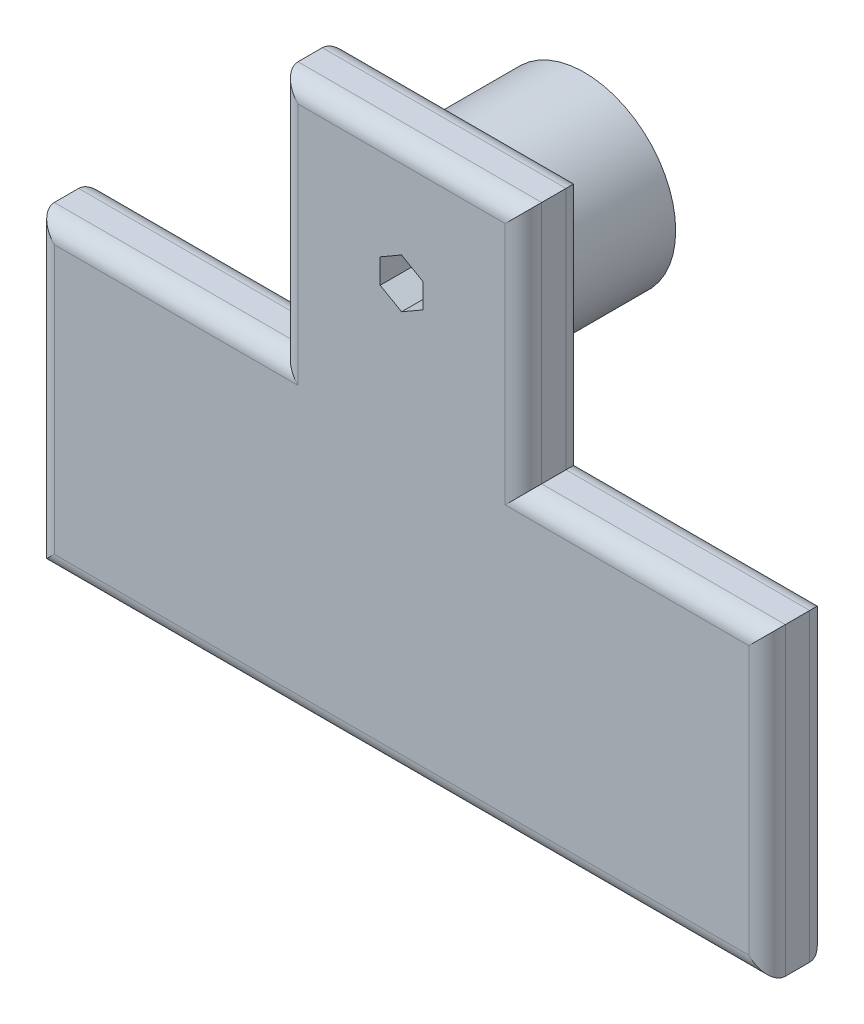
ISO-10303-21;
HEADER;
FILE_DESCRIPTION(('STEP AP214'),'2;1');
FILE_NAME('part.step','',(''),(''),'','','');
FILE_SCHEMA(('AUTOMOTIVE_DESIGN { 1 0 10303 214 1 1 1 1 }'));
ENDSEC;
DATA;
#1=APPLICATION_CONTEXT('core data for automotive mechanical design processes');
#2=APPLICATION_PROTOCOL_DEFINITION('international standard','automotive_design',2000,#1);
#3=PRODUCT_CONTEXT('',#1,'mechanical');
#4=PRODUCT('Part','Part','',(#3));
#5=PRODUCT_RELATED_PRODUCT_CATEGORY('part','',(#4));
#6=PRODUCT_DEFINITION_FORMATION('','',#4);
#7=PRODUCT_DEFINITION_CONTEXT('part definition',#1,'design');
#8=PRODUCT_DEFINITION('design','',#6,#7);
#9=PRODUCT_DEFINITION_SHAPE('','',#8);
#10=(LENGTH_UNIT() NAMED_UNIT(*) SI_UNIT(.MILLI.,.METRE.));
#11=(NAMED_UNIT(*) PLANE_ANGLE_UNIT() SI_UNIT($,.RADIAN.));
#12=(NAMED_UNIT(*) SI_UNIT($,.STERADIAN.) SOLID_ANGLE_UNIT());
#13=UNCERTAINTY_MEASURE_WITH_UNIT(LENGTH_MEASURE(1.E-05),#10,'distance_accuracy_value','');
#14=(GEOMETRIC_REPRESENTATION_CONTEXT(3) GLOBAL_UNCERTAINTY_ASSIGNED_CONTEXT((#13)) GLOBAL_UNIT_ASSIGNED_CONTEXT((#10,
#11,#12)) REPRESENTATION_CONTEXT('',''));
#15=CARTESIAN_POINT('',(0.,0.,0.));
#16=DIRECTION('',(0.,0.,1.));
#17=DIRECTION('',(1.,0.,0.));
#18=AXIS2_PLACEMENT_3D('',#15,#16,#17);
#19=CARTESIAN_POINT('',(0.,0.,-20.));
#20=DIRECTION('',(0.,0.,1.));
#21=DIRECTION('',(1.,0.,0.));
#22=AXIS2_PLACEMENT_3D('',#19,#20,#21);
#23=PLANE('',#22);
#24=CARTESIAN_POINT('',(0.,0.,-20.));
#25=DIRECTION('',(0.,0.,1.));
#26=DIRECTION('',(1.,0.,0.));
#27=AXIS2_PLACEMENT_3D('',#24,#25,#26);
#28=CIRCLE('',#27,15.);
#29=CARTESIAN_POINT('',(15.,0.,-20.));
#30=VERTEX_POINT('',#29);
#31=EDGE_CURVE('E219',#30,#30,#28,.T.);
#32=ORIENTED_EDGE('',*,*,#31,.F.);
#33=EDGE_LOOP('',(#32));
#34=FACE_BOUND('',#33,.T.);
#35=DIRECTION('',(0.866025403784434,-0.500000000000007,0.));
#36=VECTOR('',#35,1.);
#37=CARTESIAN_POINT('',(0.,4.0414518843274,-20.));
#38=LINE('',#37,#36);
#39=CARTESIAN_POINT('',(0.,4.0414518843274,-20.));
#40=VERTEX_POINT('',#39);
#41=CARTESIAN_POINT('',(3.50000000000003,2.02072594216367,-20.));
#42=VERTEX_POINT('',#41);
#43=EDGE_CURVE('E199',#40,#42,#38,.T.);
#44=ORIENTED_EDGE('',*,*,#43,.F.);
#45=DIRECTION('',(0.866025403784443,0.499999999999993,0.));
#46=VECTOR('',#45,1.);
#47=CARTESIAN_POINT('',(-3.5,2.02072594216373,-20.));
#48=LINE('',#47,#46);
#49=CARTESIAN_POINT('',(-3.5,2.02072594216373,-20.));
#50=VERTEX_POINT('',#49);
#51=EDGE_CURVE('E216',#50,#40,#48,.T.);
#52=ORIENTED_EDGE('',*,*,#51,.F.);
#53=DIRECTION('',(0.,1.,0.));
#54=VECTOR('',#53,1.);
#55=CARTESIAN_POINT('',(-3.50000000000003,-2.02072594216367,-20.));
#56=LINE('',#55,#54);
#57=CARTESIAN_POINT('',(-3.50000000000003,-2.02072594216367,-20.));
#58=VERTEX_POINT('',#57);
#59=EDGE_CURVE('E214',#58,#50,#56,.T.);
#60=ORIENTED_EDGE('',*,*,#59,.F.);
#61=DIRECTION('',(-0.866025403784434,0.500000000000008,0.));
#62=VECTOR('',#61,1.);
#63=CARTESIAN_POINT('',(0.,-4.0414518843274,-20.));
#64=LINE('',#63,#62);
#65=CARTESIAN_POINT('',(0.,-4.0414518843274,-20.));
#66=VERTEX_POINT('',#65);
#67=EDGE_CURVE('E209',#66,#58,#64,.T.);
#68=ORIENTED_EDGE('',*,*,#67,.F.);
#69=DIRECTION('',(-0.866025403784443,-0.499999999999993,0.));
#70=VECTOR('',#69,1.);
#71=CARTESIAN_POINT('',(3.49999999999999,-2.02072594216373,-20.));
#72=LINE('',#71,#70);
#73=CARTESIAN_POINT('',(3.49999999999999,-2.02072594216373,-20.));
#74=VERTEX_POINT('',#73);
#75=EDGE_CURVE('E207',#74,#66,#72,.T.);
#76=ORIENTED_EDGE('',*,*,#75,.F.);
#77=DIRECTION('',(0.,-1.,0.));
#78=VECTOR('',#77,1.);
#79=CARTESIAN_POINT('',(3.50000000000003,2.02072594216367,-20.));
#80=LINE('',#79,#78);
#81=EDGE_CURVE('E189',#42,#74,#80,.T.);
#82=ORIENTED_EDGE('',*,*,#81,.F.);
#83=EDGE_LOOP('',(#44,#52,#60,#68,#76,#82));
#84=FACE_BOUND('',#83,.T.);
#85=ADVANCED_FACE('F33',(#34,#84),#23,.F.);
#86=CARTESIAN_POINT('',(0.,0.,10.));
#87=DIRECTION('',(0.,0.,1.));
#88=DIRECTION('',(1.,0.,0.));
#89=AXIS2_PLACEMENT_3D('',#86,#87,#88);
#90=PLANE('',#89);
#91=DIRECTION('',(0.,-1.,0.));
#92=VECTOR('',#91,1.);
#93=CARTESIAN_POINT('',(-57.,-70.,10.));
#94=LINE('',#93,#92);
#95=CARTESIAN_POINT('',(-57.,-23.,10.));
#96=VERTEX_POINT('',#95);
#97=CARTESIAN_POINT('',(-57.,-67.,10.));
#98=VERTEX_POINT('',#97);
#99=EDGE_CURVE('E280',#96,#98,#94,.T.);
#100=ORIENTED_EDGE('',*,*,#99,.T.);
#101=DIRECTION('',(1.,0.,0.));
#102=VECTOR('',#101,1.);
#103=CARTESIAN_POINT('',(60.,-67.,10.));
#104=LINE('',#103,#102);
#105=CARTESIAN_POINT('',(57.,-67.,10.));
#106=VERTEX_POINT('',#105);
#107=EDGE_CURVE('E282',#98,#106,#104,.T.);
#108=ORIENTED_EDGE('',*,*,#107,.T.);
#109=DIRECTION('',(0.,1.,0.));
#110=VECTOR('',#109,1.);
#111=CARTESIAN_POINT('',(57.,-20.,10.));
#112=LINE('',#111,#110);
#113=CARTESIAN_POINT('',(57.,-23.,10.));
#114=VERTEX_POINT('',#113);
#115=EDGE_CURVE('E268',#106,#114,#112,.T.);
#116=ORIENTED_EDGE('',*,*,#115,.T.);
#117=DIRECTION('',(-1.,0.,0.));
#118=VECTOR('',#117,1.);
#119=CARTESIAN_POINT('',(20.,-23.,10.));
#120=LINE('',#119,#118);
#121=CARTESIAN_POINT('',(17.,-23.,10.));
#122=VERTEX_POINT('',#121);
#123=EDGE_CURVE('E270',#114,#122,#120,.T.);
#124=ORIENTED_EDGE('',*,*,#123,.T.);
#125=DIRECTION('',(0.,1.,0.));
#126=VECTOR('',#125,1.);
#127=CARTESIAN_POINT('',(17.,20.,10.));
#128=LINE('',#127,#126);
#129=CARTESIAN_POINT('',(17.,17.,10.));
#130=VERTEX_POINT('',#129);
#131=EDGE_CURVE('E272',#122,#130,#128,.T.);
#132=ORIENTED_EDGE('',*,*,#131,.T.);
#133=DIRECTION('',(-1.,0.,0.));
#134=VECTOR('',#133,1.);
#135=CARTESIAN_POINT('',(-20.,17.,10.));
#136=LINE('',#135,#134);
#137=CARTESIAN_POINT('',(-17.,17.,10.));
#138=VERTEX_POINT('',#137);
#139=EDGE_CURVE('E274',#130,#138,#136,.T.);
#140=ORIENTED_EDGE('',*,*,#139,.T.);
#141=DIRECTION('',(0.,-1.,0.));
#142=VECTOR('',#141,1.);
#143=CARTESIAN_POINT('',(-17.,-20.,10.));
#144=LINE('',#143,#142);
#145=CARTESIAN_POINT('',(-17.,-23.,10.));
#146=VERTEX_POINT('',#145);
#147=EDGE_CURVE('E276',#138,#146,#144,.T.);
#148=ORIENTED_EDGE('',*,*,#147,.T.);
#149=DIRECTION('',(-1.,0.,0.));
#150=VECTOR('',#149,1.);
#151=CARTESIAN_POINT('',(-60.,-23.,10.));
#152=LINE('',#151,#150);
#153=EDGE_CURVE('E278',#146,#96,#152,.T.);
#154=ORIENTED_EDGE('',*,*,#153,.T.);
#155=EDGE_LOOP('',(#100,#108,#116,#124,#132,#140,#148,#154));
#156=FACE_BOUND('',#155,.T.);
#157=DIRECTION('',(0.866025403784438,0.5,0.));
#158=VECTOR('',#157,1.);
#159=CARTESIAN_POINT('',(0.,-4.04145188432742,10.));
#160=LINE('',#159,#158);
#161=CARTESIAN_POINT('',(0.,-4.04145188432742,10.));
#162=VERTEX_POINT('',#161);
#163=CARTESIAN_POINT('',(3.50000000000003,-2.02072594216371,10.));
#164=VERTEX_POINT('',#163);
#165=EDGE_CURVE('E227',#162,#164,#160,.T.);
#166=ORIENTED_EDGE('',*,*,#165,.F.);
#167=DIRECTION('',(0.866025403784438,-0.5,0.));
#168=VECTOR('',#167,1.);
#169=CARTESIAN_POINT('',(-3.50000000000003,-2.02072594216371,10.));
#170=LINE('',#169,#168);
#171=CARTESIAN_POINT('',(-3.50000000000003,-2.02072594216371,10.));
#172=VERTEX_POINT('',#171);
#173=EDGE_CURVE('E225',#172,#162,#170,.T.);
#174=ORIENTED_EDGE('',*,*,#173,.F.);
#175=DIRECTION('',(0.,-1.,0.));
#176=VECTOR('',#175,1.);
#177=CARTESIAN_POINT('',(-3.50000000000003,2.02072594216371,10.));
#178=LINE('',#177,#176);
#179=CARTESIAN_POINT('',(-3.50000000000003,2.02072594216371,10.));
#180=VERTEX_POINT('',#179);
#181=EDGE_CURVE('E235',#180,#172,#178,.T.);
#182=ORIENTED_EDGE('',*,*,#181,.F.);
#183=DIRECTION('',(-0.866025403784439,-0.5,0.));
#184=VECTOR('',#183,1.);
#185=CARTESIAN_POINT('',(0.,4.04145188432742,10.));
#186=LINE('',#185,#184);
#187=CARTESIAN_POINT('',(0.,4.04145188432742,10.));
#188=VERTEX_POINT('',#187);
#189=EDGE_CURVE('E233',#188,#180,#186,.T.);
#190=ORIENTED_EDGE('',*,*,#189,.F.);
#191=DIRECTION('',(-0.866025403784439,0.5,0.));
#192=VECTOR('',#191,1.);
#193=CARTESIAN_POINT('',(3.50000000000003,2.02072594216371,10.));
#194=LINE('',#193,#192);
#195=CARTESIAN_POINT('',(3.50000000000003,2.02072594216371,10.));
#196=VERTEX_POINT('',#195);
#197=EDGE_CURVE('E231',#196,#188,#194,.T.);
#198=ORIENTED_EDGE('',*,*,#197,.F.);
#199=DIRECTION('',(0.,1.,0.));
#200=VECTOR('',#199,1.);
#201=CARTESIAN_POINT('',(3.50000000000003,-2.02072594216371,10.));
#202=LINE('',#201,#200);
#203=EDGE_CURVE('E192',#164,#196,#202,.T.);
#204=ORIENTED_EDGE('',*,*,#203,.F.);
#205=EDGE_LOOP('',(#166,#174,#182,#190,#198,#204));
#206=FACE_BOUND('',#205,.T.);
#207=ADVANCED_FACE('F415',(#156,#206),#90,.T.);
#208=CARTESIAN_POINT('',(0.,0.,0.));
#209=DIRECTION('',(0.,0.,1.));
#210=DIRECTION('',(1.,0.,0.));
#211=AXIS2_PLACEMENT_3D('',#208,#209,#210);
#212=PLANE('',#211);
#213=CARTESIAN_POINT('',(0.,0.,0.));
#214=DIRECTION('',(0.,0.,1.));
#215=DIRECTION('',(1.,0.,0.));
#216=AXIS2_PLACEMENT_3D('',#213,#214,#215);
#217=CIRCLE('',#216,15.);
#218=CARTESIAN_POINT('',(15.,0.,0.));
#219=VERTEX_POINT('',#218);
#220=EDGE_CURVE('E218',#219,#219,#217,.T.);
#221=ORIENTED_EDGE('',*,*,#220,.T.);
#222=EDGE_LOOP('',(#221));
#223=FACE_BOUND('',#222,.T.);
#224=DIRECTION('',(-1.,0.,0.));
#225=VECTOR('',#224,1.);
#226=CARTESIAN_POINT('',(0.,17.,0.));
#227=LINE('',#226,#225);
#228=CARTESIAN_POINT('',(-17.,17.,0.));
#229=VERTEX_POINT('',#228);
#230=CARTESIAN_POINT('',(17.,17.,0.));
#231=VERTEX_POINT('',#230);
#232=EDGE_CURVE('E42',#229,#231,#227,.F.);
#233=ORIENTED_EDGE('',*,*,#232,.T.);
#234=DIRECTION('',(0.,1.,0.));
#235=VECTOR('',#234,1.);
#236=CARTESIAN_POINT('',(17.,0.,0.));
#237=LINE('',#236,#235);
#238=CARTESIAN_POINT('',(17.,-23.,0.));
#239=VERTEX_POINT('',#238);
#240=EDGE_CURVE('E11',#231,#239,#237,.F.);
#241=ORIENTED_EDGE('',*,*,#240,.T.);
#242=DIRECTION('',(-1.,0.,0.));
#243=VECTOR('',#242,1.);
#244=CARTESIAN_POINT('',(0.,-23.,0.));
#245=LINE('',#244,#243);
#246=CARTESIAN_POINT('',(57.,-23.,0.));
#247=VERTEX_POINT('',#246);
#248=EDGE_CURVE('E325',#239,#247,#245,.F.);
#249=ORIENTED_EDGE('',*,*,#248,.T.);
#250=DIRECTION('',(0.,1.,0.));
#251=VECTOR('',#250,1.);
#252=CARTESIAN_POINT('',(57.,0.,0.));
#253=LINE('',#252,#251);
#254=CARTESIAN_POINT('',(57.,-67.,0.));
#255=VERTEX_POINT('',#254);
#256=EDGE_CURVE('E323',#247,#255,#253,.F.);
#257=ORIENTED_EDGE('',*,*,#256,.T.);
#258=DIRECTION('',(1.,0.,0.));
#259=VECTOR('',#258,1.);
#260=CARTESIAN_POINT('',(0.,-67.,0.));
#261=LINE('',#260,#259);
#262=CARTESIAN_POINT('',(-57.,-67.,0.));
#263=VERTEX_POINT('',#262);
#264=EDGE_CURVE('E321',#255,#263,#261,.F.);
#265=ORIENTED_EDGE('',*,*,#264,.T.);
#266=DIRECTION('',(0.,-1.,0.));
#267=VECTOR('',#266,1.);
#268=CARTESIAN_POINT('',(-57.,0.,0.));
#269=LINE('',#268,#267);
#270=CARTESIAN_POINT('',(-57.,-23.,0.));
#271=VERTEX_POINT('',#270);
#272=EDGE_CURVE('E319',#263,#271,#269,.F.);
#273=ORIENTED_EDGE('',*,*,#272,.T.);
#274=DIRECTION('',(-1.,0.,0.));
#275=VECTOR('',#274,1.);
#276=CARTESIAN_POINT('',(0.,-23.,0.));
#277=LINE('',#276,#275);
#278=CARTESIAN_POINT('',(-17.,-23.,0.));
#279=VERTEX_POINT('',#278);
#280=EDGE_CURVE('E327',#271,#279,#277,.F.);
#281=ORIENTED_EDGE('',*,*,#280,.T.);
#282=DIRECTION('',(0.,-1.,0.));
#283=VECTOR('',#282,1.);
#284=CARTESIAN_POINT('',(-17.,0.,0.));
#285=LINE('',#284,#283);
#286=EDGE_CURVE('E329',#279,#229,#285,.F.);
#287=ORIENTED_EDGE('',*,*,#286,.T.);
#288=EDGE_LOOP('',(#233,#241,#249,#257,#265,#273,#281,#287));
#289=FACE_BOUND('',#288,.T.);
#290=ADVANCED_FACE('F383',(#223,#289),#212,.F.);
#291=CARTESIAN_POINT('',(60.,-20.,10.));
#292=DIRECTION('',(-1.,0.,0.));
#293=DIRECTION('',(0.,-1.,0.));
#294=AXIS2_PLACEMENT_3D('',#291,#292,#293);
#295=PLANE('',#294);
#296=DIRECTION('',(0.,0.,-1.));
#297=VECTOR('',#296,1.);
#298=CARTESIAN_POINT('',(60.,-20.,10.));
#299=LINE('',#298,#297);
#300=CARTESIAN_POINT('',(60.,-20.,7.));
#301=VERTEX_POINT('',#300);
#302=CARTESIAN_POINT('',(60.,-20.,3.));
#303=VERTEX_POINT('',#302);
#304=EDGE_CURVE('E265',#301,#303,#299,.T.);
#305=ORIENTED_EDGE('',*,*,#304,.F.);
#306=DIRECTION('',(0.,1.,0.));
#307=VECTOR('',#306,1.);
#308=CARTESIAN_POINT('',(60.,-70.,7.));
#309=LINE('',#308,#307);
#310=CARTESIAN_POINT('',(60.,-70.,7.));
#311=VERTEX_POINT('',#310);
#312=EDGE_CURVE('E317',#301,#311,#309,.F.);
#313=ORIENTED_EDGE('',*,*,#312,.T.);
#314=DIRECTION('',(0.,0.,-1.));
#315=VECTOR('',#314,1.);
#316=CARTESIAN_POINT('',(60.,-70.,10.));
#317=LINE('',#316,#315);
#318=CARTESIAN_POINT('',(60.,-70.,3.));
#319=VERTEX_POINT('',#318);
#320=EDGE_CURVE('E244',#311,#319,#317,.T.);
#321=ORIENTED_EDGE('',*,*,#320,.T.);
#322=DIRECTION('',(0.,1.,0.));
#323=VECTOR('',#322,1.);
#324=CARTESIAN_POINT('',(60.,-20.,3.));
#325=LINE('',#324,#323);
#326=EDGE_CURVE('E315',#319,#303,#325,.T.);
#327=ORIENTED_EDGE('',*,*,#326,.T.);
#328=EDGE_LOOP('',(#305,#313,#321,#327));
#329=FACE_BOUND('',#328,.T.);
#330=ADVANCED_FACE('F445',(#329),#295,.F.);
#331=CARTESIAN_POINT('',(60.,-20.,10.));
#332=DIRECTION('',(0.,-1.,0.));
#333=DIRECTION('',(0.,0.,-1.));
#334=AXIS2_PLACEMENT_3D('',#331,#332,#333);
#335=PLANE('',#334);
#336=DIRECTION('',(0.,0.,-1.));
#337=VECTOR('',#336,1.);
#338=CARTESIAN_POINT('',(20.,-20.,10.));
#339=LINE('',#338,#337);
#340=CARTESIAN_POINT('',(20.,-20.,7.));
#341=VERTEX_POINT('',#340);
#342=CARTESIAN_POINT('',(20.,-20.,3.));
#343=VERTEX_POINT('',#342);
#344=EDGE_CURVE('E262',#341,#343,#339,.T.);
#345=ORIENTED_EDGE('',*,*,#344,.F.);
#346=DIRECTION('',(-1.,0.,0.));
#347=VECTOR('',#346,1.);
#348=CARTESIAN_POINT('',(60.,-20.,7.));
#349=LINE('',#348,#347);
#350=EDGE_CURVE('E313',#341,#301,#349,.F.);
#351=ORIENTED_EDGE('',*,*,#350,.T.);
#352=ORIENTED_EDGE('',*,*,#304,.T.);
#353=DIRECTION('',(-1.,0.,0.));
#354=VECTOR('',#353,1.);
#355=CARTESIAN_POINT('',(60.,-20.,3.));
#356=LINE('',#355,#354);
#357=EDGE_CURVE('E311',#303,#343,#356,.T.);
#358=ORIENTED_EDGE('',*,*,#357,.T.);
#359=EDGE_LOOP('',(#345,#351,#352,#358));
#360=FACE_BOUND('',#359,.T.);
#361=ADVANCED_FACE('F429',(#360),#335,.F.);
#362=CARTESIAN_POINT('',(20.,20.,10.));
#363=DIRECTION('',(-1.,0.,0.));
#364=DIRECTION('',(0.,-1.,0.));
#365=AXIS2_PLACEMENT_3D('',#362,#363,#364);
#366=PLANE('',#365);
#367=DIRECTION('',(0.,0.,-1.));
#368=VECTOR('',#367,1.);
#369=CARTESIAN_POINT('',(20.,20.,10.));
#370=LINE('',#369,#368);
#371=CARTESIAN_POINT('',(20.,20.,7.));
#372=VERTEX_POINT('',#371);
#373=CARTESIAN_POINT('',(20.,20.,3.));
#374=VERTEX_POINT('',#373);
#375=EDGE_CURVE('E259',#372,#374,#370,.T.);
#376=ORIENTED_EDGE('',*,*,#375,.F.);
#377=DIRECTION('',(0.,1.,0.));
#378=VECTOR('',#377,1.);
#379=CARTESIAN_POINT('',(20.,-20.,7.));
#380=LINE('',#379,#378);
#381=EDGE_CURVE('E309',#372,#341,#380,.F.);
#382=ORIENTED_EDGE('',*,*,#381,.T.);
#383=ORIENTED_EDGE('',*,*,#344,.T.);
#384=DIRECTION('',(0.,1.,0.));
#385=VECTOR('',#384,1.);
#386=CARTESIAN_POINT('',(20.,20.,3.));
#387=LINE('',#386,#385);
#388=EDGE_CURVE('E307',#343,#374,#387,.T.);
#389=ORIENTED_EDGE('',*,*,#388,.T.);
#390=EDGE_LOOP('',(#376,#382,#383,#389));
#391=FACE_BOUND('',#390,.T.);
#392=ADVANCED_FACE('F425',(#391),#366,.F.);
#393=CARTESIAN_POINT('',(-20.,20.,10.));
#394=DIRECTION('',(0.,-1.,0.));
#395=DIRECTION('',(0.,0.,-1.));
#396=AXIS2_PLACEMENT_3D('',#393,#394,#395);
#397=PLANE('',#396);
#398=DIRECTION('',(0.,0.,-1.));
#399=VECTOR('',#398,1.);
#400=CARTESIAN_POINT('',(-20.,20.,10.));
#401=LINE('',#400,#399);
#402=CARTESIAN_POINT('',(-20.,20.,7.));
#403=VERTEX_POINT('',#402);
#404=CARTESIAN_POINT('',(-20.,20.,3.));
#405=VERTEX_POINT('',#404);
#406=EDGE_CURVE('E256',#403,#405,#401,.T.);
#407=ORIENTED_EDGE('',*,*,#406,.F.);
#408=DIRECTION('',(-1.,0.,0.));
#409=VECTOR('',#408,1.);
#410=CARTESIAN_POINT('',(20.,20.,7.));
#411=LINE('',#410,#409);
#412=EDGE_CURVE('E305',#403,#372,#411,.F.);
#413=ORIENTED_EDGE('',*,*,#412,.T.);
#414=ORIENTED_EDGE('',*,*,#375,.T.);
#415=DIRECTION('',(-1.,0.,0.));
#416=VECTOR('',#415,1.);
#417=CARTESIAN_POINT('',(-20.,20.,3.));
#418=LINE('',#417,#416);
#419=EDGE_CURVE('E303',#374,#405,#418,.T.);
#420=ORIENTED_EDGE('',*,*,#419,.T.);
#421=EDGE_LOOP('',(#407,#413,#414,#420));
#422=FACE_BOUND('',#421,.T.);
#423=ADVANCED_FACE('F396',(#422),#397,.F.);
#424=CARTESIAN_POINT('',(-20.,20.,10.));
#425=DIRECTION('',(1.,0.,0.));
#426=DIRECTION('',(0.,1.,0.));
#427=AXIS2_PLACEMENT_3D('',#424,#425,#426);
#428=PLANE('',#427);
#429=DIRECTION('',(0.,0.,-1.));
#430=VECTOR('',#429,1.);
#431=CARTESIAN_POINT('',(-20.,-20.,10.));
#432=LINE('',#431,#430);
#433=CARTESIAN_POINT('',(-20.,-20.,7.));
#434=VERTEX_POINT('',#433);
#435=CARTESIAN_POINT('',(-20.,-20.,3.));
#436=VERTEX_POINT('',#435);
#437=EDGE_CURVE('E253',#434,#436,#432,.T.);
#438=ORIENTED_EDGE('',*,*,#437,.F.);
#439=DIRECTION('',(0.,-1.,0.));
#440=VECTOR('',#439,1.);
#441=CARTESIAN_POINT('',(-20.,20.,7.));
#442=LINE('',#441,#440);
#443=EDGE_CURVE('E301',#434,#403,#442,.F.);
#444=ORIENTED_EDGE('',*,*,#443,.T.);
#445=ORIENTED_EDGE('',*,*,#406,.T.);
#446=DIRECTION('',(0.,-1.,0.));
#447=VECTOR('',#446,1.);
#448=CARTESIAN_POINT('',(-20.,20.,3.));
#449=LINE('',#448,#447);
#450=EDGE_CURVE('E298',#405,#436,#449,.T.);
#451=ORIENTED_EDGE('',*,*,#450,.T.);
#452=EDGE_LOOP('',(#438,#444,#445,#451));
#453=FACE_BOUND('',#452,.T.);
#454=ADVANCED_FACE('F401',(#453),#428,.F.);
#455=CARTESIAN_POINT('',(-60.,-20.,10.));
#456=DIRECTION('',(0.,-1.,0.));
#457=DIRECTION('',(0.,0.,-1.));
#458=AXIS2_PLACEMENT_3D('',#455,#456,#457);
#459=PLANE('',#458);
#460=DIRECTION('',(0.,0.,-1.));
#461=VECTOR('',#460,1.);
#462=CARTESIAN_POINT('',(-60.,-20.,10.));
#463=LINE('',#462,#461);
#464=CARTESIAN_POINT('',(-60.,-20.,7.));
#465=VERTEX_POINT('',#464);
#466=CARTESIAN_POINT('',(-60.,-20.,3.));
#467=VERTEX_POINT('',#466);
#468=EDGE_CURVE('E250',#465,#467,#463,.T.);
#469=ORIENTED_EDGE('',*,*,#468,.F.);
#470=DIRECTION('',(-1.,0.,0.));
#471=VECTOR('',#470,1.);
#472=CARTESIAN_POINT('',(-20.,-20.,7.));
#473=LINE('',#472,#471);
#474=EDGE_CURVE('E296',#465,#434,#473,.F.);
#475=ORIENTED_EDGE('',*,*,#474,.T.);
#476=ORIENTED_EDGE('',*,*,#437,.T.);
#477=DIRECTION('',(-1.,0.,0.));
#478=VECTOR('',#477,1.);
#479=CARTESIAN_POINT('',(-60.,-20.,3.));
#480=LINE('',#479,#478);
#481=EDGE_CURVE('E294',#436,#467,#480,.T.);
#482=ORIENTED_EDGE('',*,*,#481,.T.);
#483=EDGE_LOOP('',(#469,#475,#476,#482));
#484=FACE_BOUND('',#483,.T.);
#485=ADVANCED_FACE('F461',(#484),#459,.F.);
#486=CARTESIAN_POINT('',(-60.,-20.,10.));
#487=DIRECTION('',(1.,0.,0.));
#488=DIRECTION('',(0.,1.,0.));
#489=AXIS2_PLACEMENT_3D('',#486,#487,#488);
#490=PLANE('',#489);
#491=DIRECTION('',(0.,0.,-1.));
#492=VECTOR('',#491,1.);
#493=CARTESIAN_POINT('',(-60.,-70.,10.));
#494=LINE('',#493,#492);
#495=CARTESIAN_POINT('',(-60.,-70.,7.));
#496=VERTEX_POINT('',#495);
#497=CARTESIAN_POINT('',(-60.,-70.,3.));
#498=VERTEX_POINT('',#497);
#499=EDGE_CURVE('E247',#496,#498,#494,.T.);
#500=ORIENTED_EDGE('',*,*,#499,.F.);
#501=DIRECTION('',(0.,-1.,0.));
#502=VECTOR('',#501,1.);
#503=CARTESIAN_POINT('',(-60.,-20.,7.));
#504=LINE('',#503,#502);
#505=EDGE_CURVE('E292',#496,#465,#504,.F.);
#506=ORIENTED_EDGE('',*,*,#505,.T.);
#507=ORIENTED_EDGE('',*,*,#468,.T.);
#508=DIRECTION('',(0.,-1.,0.));
#509=VECTOR('',#508,1.);
#510=CARTESIAN_POINT('',(-60.,-20.,3.));
#511=LINE('',#510,#509);
#512=EDGE_CURVE('E290',#467,#498,#511,.T.);
#513=ORIENTED_EDGE('',*,*,#512,.T.);
#514=EDGE_LOOP('',(#500,#506,#507,#513));
#515=FACE_BOUND('',#514,.T.);
#516=ADVANCED_FACE('F458',(#515),#490,.F.);
#517=CARTESIAN_POINT('',(-60.,-70.,10.));
#518=DIRECTION('',(0.,1.,0.));
#519=DIRECTION('',(0.,0.,1.));
#520=AXIS2_PLACEMENT_3D('',#517,#518,#519);
#521=PLANE('',#520);
#522=ORIENTED_EDGE('',*,*,#320,.F.);
#523=DIRECTION('',(1.,0.,0.));
#524=VECTOR('',#523,1.);
#525=CARTESIAN_POINT('',(-60.,-70.,7.));
#526=LINE('',#525,#524);
#527=EDGE_CURVE('E287',#311,#496,#526,.F.);
#528=ORIENTED_EDGE('',*,*,#527,.T.);
#529=ORIENTED_EDGE('',*,*,#499,.T.);
#530=DIRECTION('',(1.,0.,0.));
#531=VECTOR('',#530,1.);
#532=CARTESIAN_POINT('',(-60.,-70.,3.));
#533=LINE('',#532,#531);
#534=EDGE_CURVE('E285',#498,#319,#533,.T.);
#535=ORIENTED_EDGE('',*,*,#534,.T.);
#536=EDGE_LOOP('',(#522,#528,#529,#535));
#537=FACE_BOUND('',#536,.T.);
#538=ADVANCED_FACE('F448',(#537),#521,.F.);
#539=CARTESIAN_POINT('',(-3.50000000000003,-2.02072594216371,10.));
#540=DIRECTION('',(0.5,0.866025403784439,0.));
#541=DIRECTION('',(-0.866025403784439,0.5,0.));
#542=AXIS2_PLACEMENT_3D('',#539,#540,#541);
#543=PLANE('',#542);
#544=DIRECTION('',(0.,0.,-1.));
#545=VECTOR('',#544,1.);
#546=CARTESIAN_POINT('',(0.,-4.04145188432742,10.));
#547=LINE('',#546,#545);
#548=EDGE_CURVE('E242',#162,#66,#547,.T.);
#549=ORIENTED_EDGE('',*,*,#548,.T.);
#550=ORIENTED_EDGE('',*,*,#67,.T.);
#551=DIRECTION('',(0.,0.,-1.));
#552=VECTOR('',#551,1.);
#553=CARTESIAN_POINT('',(-3.50000000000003,-2.02072594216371,10.));
#554=LINE('',#553,#552);
#555=EDGE_CURVE('E237',#172,#58,#554,.T.);
#556=ORIENTED_EDGE('',*,*,#555,.F.);
#557=ORIENTED_EDGE('',*,*,#173,.T.);
#558=EDGE_LOOP('',(#549,#550,#556,#557));
#559=FACE_BOUND('',#558,.T.);
#560=ADVANCED_FACE('F507',(#559),#543,.T.);
#561=CARTESIAN_POINT('',(0.,-4.04145188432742,10.));
#562=DIRECTION('',(-0.5,0.866025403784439,0.));
#563=DIRECTION('',(-0.866025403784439,-0.5,0.));
#564=AXIS2_PLACEMENT_3D('',#561,#562,#563);
#565=PLANE('',#564);
#566=DIRECTION('',(0.,0.,-1.));
#567=VECTOR('',#566,1.);
#568=CARTESIAN_POINT('',(3.50000000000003,-2.02072594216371,10.));
#569=LINE('',#568,#567);
#570=EDGE_CURVE('E195',#164,#74,#569,.T.);
#571=ORIENTED_EDGE('',*,*,#570,.T.);
#572=ORIENTED_EDGE('',*,*,#75,.T.);
#573=ORIENTED_EDGE('',*,*,#548,.F.);
#574=ORIENTED_EDGE('',*,*,#165,.T.);
#575=EDGE_LOOP('',(#571,#572,#573,#574));
#576=FACE_BOUND('',#575,.T.);
#577=ADVANCED_FACE('F504',(#576),#565,.T.);
#578=CARTESIAN_POINT('',(3.50000000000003,-2.02072594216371,10.));
#579=DIRECTION('',(-1.,0.,0.));
#580=DIRECTION('',(0.,0.,1.));
#581=AXIS2_PLACEMENT_3D('',#578,#579,#580);
#582=PLANE('',#581);
#583=DIRECTION('',(0.,0.,-1.));
#584=VECTOR('',#583,1.);
#585=CARTESIAN_POINT('',(3.50000000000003,2.02072594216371,10.));
#586=LINE('',#585,#584);
#587=EDGE_CURVE('E184',#196,#42,#586,.T.);
#588=ORIENTED_EDGE('',*,*,#587,.T.);
#589=ORIENTED_EDGE('',*,*,#81,.T.);
#590=ORIENTED_EDGE('',*,*,#570,.F.);
#591=ORIENTED_EDGE('',*,*,#203,.T.);
#592=EDGE_LOOP('',(#588,#589,#590,#591));
#593=FACE_BOUND('',#592,.T.);
#594=ADVANCED_FACE('F186',(#593),#582,.T.);
#595=CARTESIAN_POINT('',(3.50000000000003,2.02072594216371,10.));
#596=DIRECTION('',(-0.5,-0.866025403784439,0.));
#597=DIRECTION('',(0.866025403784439,-0.5,0.));
#598=AXIS2_PLACEMENT_3D('',#595,#596,#597);
#599=PLANE('',#598);
#600=DIRECTION('',(0.,0.,-1.));
#601=VECTOR('',#600,1.);
#602=CARTESIAN_POINT('',(0.,4.04145188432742,10.));
#603=LINE('',#602,#601);
#604=EDGE_CURVE('E196',#188,#40,#603,.T.);
#605=ORIENTED_EDGE('',*,*,#604,.T.);
#606=ORIENTED_EDGE('',*,*,#43,.T.);
#607=ORIENTED_EDGE('',*,*,#587,.F.);
#608=ORIENTED_EDGE('',*,*,#197,.T.);
#609=EDGE_LOOP('',(#605,#606,#607,#608));
#610=FACE_BOUND('',#609,.T.);
#611=ADVANCED_FACE('F200',(#610),#599,.T.);
#612=CARTESIAN_POINT('',(0.,4.04145188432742,10.));
#613=DIRECTION('',(0.5,-0.866025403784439,0.));
#614=DIRECTION('',(0.866025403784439,0.5,0.));
#615=AXIS2_PLACEMENT_3D('',#612,#613,#614);
#616=PLANE('',#615);
#617=DIRECTION('',(0.,0.,-1.));
#618=VECTOR('',#617,1.);
#619=CARTESIAN_POINT('',(-3.50000000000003,2.02072594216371,10.));
#620=LINE('',#619,#618);
#621=EDGE_CURVE('E50',#180,#50,#620,.T.);
#622=ORIENTED_EDGE('',*,*,#621,.T.);
#623=ORIENTED_EDGE('',*,*,#51,.T.);
#624=ORIENTED_EDGE('',*,*,#604,.F.);
#625=ORIENTED_EDGE('',*,*,#189,.T.);
#626=EDGE_LOOP('',(#622,#623,#624,#625));
#627=FACE_BOUND('',#626,.T.);
#628=ADVANCED_FACE('F496',(#627),#616,.T.);
#629=CARTESIAN_POINT('',(-3.50000000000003,2.02072594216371,10.));
#630=DIRECTION('',(1.,0.,0.));
#631=DIRECTION('',(0.,1.,0.));
#632=AXIS2_PLACEMENT_3D('',#629,#630,#631);
#633=PLANE('',#632);
#634=ORIENTED_EDGE('',*,*,#555,.T.);
#635=ORIENTED_EDGE('',*,*,#59,.T.);
#636=ORIENTED_EDGE('',*,*,#621,.F.);
#637=ORIENTED_EDGE('',*,*,#181,.T.);
#638=EDGE_LOOP('',(#634,#635,#636,#637));
#639=FACE_BOUND('',#638,.T.);
#640=ADVANCED_FACE('F493',(#639),#633,.T.);
#641=CARTESIAN_POINT('',(0.,17.,7.));
#642=DIRECTION('',(1.,0.,0.));
#643=DIRECTION('',(0.,0.,-1.));
#644=AXIS2_PLACEMENT_3D('',#641,#642,#643);
#645=CYLINDRICAL_SURFACE('',#644,3.);
#646=CARTESIAN_POINT('',(17.,17.,7.));
#647=DIRECTION('',(0.707106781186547,-0.707106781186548,0.));
#648=DIRECTION('',(-0.707106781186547,-0.707106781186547,0.));
#649=AXIS2_PLACEMENT_3D('',#646,#647,#648);
#650=ELLIPSE('',#649,4.24264068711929,3.);
#651=EDGE_CURVE('E348',#372,#130,#650,.T.);
#652=ORIENTED_EDGE('',*,*,#651,.F.);
#653=ORIENTED_EDGE('',*,*,#412,.F.);
#654=CARTESIAN_POINT('',(-17.,17.,7.));
#655=DIRECTION('',(0.707106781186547,0.707106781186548,0.));
#656=DIRECTION('',(0.707106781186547,-0.707106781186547,0.));
#657=AXIS2_PLACEMENT_3D('',#654,#655,#656);
#658=ELLIPSE('',#657,4.24264068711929,3.);
#659=EDGE_CURVE('E228',#138,#403,#658,.F.);
#660=ORIENTED_EDGE('',*,*,#659,.F.);
#661=ORIENTED_EDGE('',*,*,#139,.F.);
#662=EDGE_LOOP('',(#652,#653,#660,#661));
#663=FACE_BOUND('',#662,.T.);
#664=ADVANCED_FACE('F422',(#663),#645,.T.);
#665=CARTESIAN_POINT('',(-17.,0.,7.));
#666=DIRECTION('',(0.,1.,0.));
#667=DIRECTION('',(-1.,0.,0.));
#668=AXIS2_PLACEMENT_3D('',#665,#666,#667);
#669=CYLINDRICAL_SURFACE('',#668,3.);
#670=ORIENTED_EDGE('',*,*,#659,.T.);
#671=ORIENTED_EDGE('',*,*,#443,.F.);
#672=CARTESIAN_POINT('',(-17.,-23.,7.));
#673=DIRECTION('',(0.707106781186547,0.707106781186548,0.));
#674=DIRECTION('',(0.707106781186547,-0.707106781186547,0.));
#675=AXIS2_PLACEMENT_3D('',#672,#673,#674);
#676=ELLIPSE('',#675,4.24264068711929,3.);
#677=EDGE_CURVE('E345',#146,#434,#676,.F.);
#678=ORIENTED_EDGE('',*,*,#677,.F.);
#679=ORIENTED_EDGE('',*,*,#147,.F.);
#680=EDGE_LOOP('',(#670,#671,#678,#679));
#681=FACE_BOUND('',#680,.T.);
#682=ADVANCED_FACE('F405',(#681),#669,.T.);
#683=CARTESIAN_POINT('',(17.,0.,7.));
#684=DIRECTION('',(0.,-1.,0.));
#685=DIRECTION('',(1.,0.,0.));
#686=AXIS2_PLACEMENT_3D('',#683,#684,#685);
#687=CYLINDRICAL_SURFACE('',#686,3.);
#688=ORIENTED_EDGE('',*,*,#651,.T.);
#689=ORIENTED_EDGE('',*,*,#131,.F.);
#690=CARTESIAN_POINT('',(17.,-23.,7.));
#691=DIRECTION('',(0.707106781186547,-0.707106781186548,0.));
#692=DIRECTION('',(-0.707106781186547,-0.707106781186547,0.));
#693=AXIS2_PLACEMENT_3D('',#690,#691,#692);
#694=ELLIPSE('',#693,4.24264068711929,3.);
#695=EDGE_CURVE('E342',#341,#122,#694,.T.);
#696=ORIENTED_EDGE('',*,*,#695,.F.);
#697=ORIENTED_EDGE('',*,*,#381,.F.);
#698=EDGE_LOOP('',(#688,#689,#696,#697));
#699=FACE_BOUND('',#698,.T.);
#700=ADVANCED_FACE('F433',(#699),#687,.T.);
#701=CARTESIAN_POINT('',(0.,-23.,7.));
#702=DIRECTION('',(1.,0.,0.));
#703=DIRECTION('',(0.,0.,-1.));
#704=AXIS2_PLACEMENT_3D('',#701,#702,#703);
#705=CYLINDRICAL_SURFACE('',#704,3.);
#706=ORIENTED_EDGE('',*,*,#677,.T.);
#707=ORIENTED_EDGE('',*,*,#474,.F.);
#708=CARTESIAN_POINT('',(-57.,-23.,7.));
#709=DIRECTION('',(0.707106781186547,0.707106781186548,0.));
#710=DIRECTION('',(0.707106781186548,-0.707106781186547,0.));
#711=AXIS2_PLACEMENT_3D('',#708,#709,#710);
#712=ELLIPSE('',#711,4.24264068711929,3.);
#713=EDGE_CURVE('E339',#96,#465,#712,.F.);
#714=ORIENTED_EDGE('',*,*,#713,.F.);
#715=ORIENTED_EDGE('',*,*,#153,.F.);
#716=EDGE_LOOP('',(#706,#707,#714,#715));
#717=FACE_BOUND('',#716,.T.);
#718=ADVANCED_FACE('F411',(#717),#705,.T.);
#719=CARTESIAN_POINT('',(0.,-23.,7.));
#720=DIRECTION('',(1.,0.,0.));
#721=DIRECTION('',(0.,0.,-1.));
#722=AXIS2_PLACEMENT_3D('',#719,#720,#721);
#723=CYLINDRICAL_SURFACE('',#722,3.);
#724=ORIENTED_EDGE('',*,*,#695,.T.);
#725=ORIENTED_EDGE('',*,*,#123,.F.);
#726=CARTESIAN_POINT('',(57.,-23.,7.));
#727=DIRECTION('',(0.707106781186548,-0.707106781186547,0.));
#728=DIRECTION('',(-0.707106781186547,-0.707106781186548,0.));
#729=AXIS2_PLACEMENT_3D('',#726,#727,#728);
#730=ELLIPSE('',#729,4.24264068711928,3.);
#731=EDGE_CURVE('E336',#301,#114,#730,.T.);
#732=ORIENTED_EDGE('',*,*,#731,.F.);
#733=ORIENTED_EDGE('',*,*,#350,.F.);
#734=EDGE_LOOP('',(#724,#725,#732,#733));
#735=FACE_BOUND('',#734,.T.);
#736=ADVANCED_FACE('F437',(#735),#723,.T.);
#737=CARTESIAN_POINT('',(-57.,0.,7.));
#738=DIRECTION('',(0.,1.,0.));
#739=DIRECTION('',(-1.,0.,0.));
#740=AXIS2_PLACEMENT_3D('',#737,#738,#739);
#741=CYLINDRICAL_SURFACE('',#740,3.);
#742=ORIENTED_EDGE('',*,*,#713,.T.);
#743=ORIENTED_EDGE('',*,*,#505,.F.);
#744=CARTESIAN_POINT('',(-57.,-67.,7.));
#745=DIRECTION('',(-0.707106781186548,0.707106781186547,0.));
#746=DIRECTION('',(0.707106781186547,0.707106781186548,0.));
#747=AXIS2_PLACEMENT_3D('',#744,#745,#746);
#748=ELLIPSE('',#747,4.24264068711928,3.);
#749=EDGE_CURVE('E334',#98,#496,#748,.F.);
#750=ORIENTED_EDGE('',*,*,#749,.F.);
#751=ORIENTED_EDGE('',*,*,#99,.F.);
#752=EDGE_LOOP('',(#742,#743,#750,#751));
#753=FACE_BOUND('',#752,.T.);
#754=ADVANCED_FACE('F455',(#753),#741,.T.);
#755=CARTESIAN_POINT('',(57.,0.,7.));
#756=DIRECTION('',(0.,-1.,0.));
#757=DIRECTION('',(1.,0.,0.));
#758=AXIS2_PLACEMENT_3D('',#755,#756,#757);
#759=CYLINDRICAL_SURFACE('',#758,3.);
#760=ORIENTED_EDGE('',*,*,#731,.T.);
#761=ORIENTED_EDGE('',*,*,#115,.F.);
#762=CARTESIAN_POINT('',(57.,-67.,7.));
#763=DIRECTION('',(-0.707106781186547,-0.707106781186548,0.));
#764=DIRECTION('',(0.707106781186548,-0.707106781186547,0.));
#765=AXIS2_PLACEMENT_3D('',#762,#763,#764);
#766=ELLIPSE('',#765,4.24264068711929,3.);
#767=EDGE_CURVE('E332',#311,#106,#766,.T.);
#768=ORIENTED_EDGE('',*,*,#767,.F.);
#769=ORIENTED_EDGE('',*,*,#312,.F.);
#770=EDGE_LOOP('',(#760,#761,#768,#769));
#771=FACE_BOUND('',#770,.T.);
#772=ADVANCED_FACE('F442',(#771),#759,.T.);
#773=CARTESIAN_POINT('',(0.,-67.,7.));
#774=DIRECTION('',(-1.,0.,0.));
#775=DIRECTION('',(0.,0.,1.));
#776=AXIS2_PLACEMENT_3D('',#773,#774,#775);
#777=CYLINDRICAL_SURFACE('',#776,3.);
#778=ORIENTED_EDGE('',*,*,#749,.T.);
#779=ORIENTED_EDGE('',*,*,#527,.F.);
#780=ORIENTED_EDGE('',*,*,#767,.T.);
#781=ORIENTED_EDGE('',*,*,#107,.F.);
#782=EDGE_LOOP('',(#778,#779,#780,#781));
#783=FACE_BOUND('',#782,.T.);
#784=ADVANCED_FACE('F451',(#783),#777,.T.);
#785=CARTESIAN_POINT('',(57.,-20.,3.));
#786=DIRECTION('',(0.,1.,0.));
#787=DIRECTION('',(-1.,0.,0.));
#788=AXIS2_PLACEMENT_3D('',#785,#786,#787);
#789=CYLINDRICAL_SURFACE('',#788,3.);
#790=CARTESIAN_POINT('',(57.,-67.,3.));
#791=DIRECTION('',(0.707106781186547,0.707106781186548,0.));
#792=DIRECTION('',(0.707106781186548,-0.707106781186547,0.));
#793=AXIS2_PLACEMENT_3D('',#790,#791,#792);
#794=ELLIPSE('',#793,4.24264068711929,3.);
#795=EDGE_CURVE('E367',#255,#319,#794,.F.);
#796=ORIENTED_EDGE('',*,*,#795,.F.);
#797=ORIENTED_EDGE('',*,*,#256,.F.);
#798=CARTESIAN_POINT('',(57.,-23.,3.));
#799=DIRECTION('',(-0.707106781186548,0.707106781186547,0.));
#800=DIRECTION('',(0.707106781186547,0.707106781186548,0.));
#801=AXIS2_PLACEMENT_3D('',#798,#799,#800);
#802=ELLIPSE('',#801,4.24264068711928,3.);
#803=EDGE_CURVE('E37',#303,#247,#802,.T.);
#804=ORIENTED_EDGE('',*,*,#803,.F.);
#805=ORIENTED_EDGE('',*,*,#326,.F.);
#806=EDGE_LOOP('',(#796,#797,#804,#805));
#807=FACE_BOUND('',#806,.T.);
#808=ADVANCED_FACE('F35',(#807),#789,.T.);
#809=CARTESIAN_POINT('',(60.,-23.,3.));
#810=DIRECTION('',(-1.,0.,0.));
#811=DIRECTION('',(0.,0.,1.));
#812=AXIS2_PLACEMENT_3D('',#809,#810,#811);
#813=CYLINDRICAL_SURFACE('',#812,3.);
#814=ORIENTED_EDGE('',*,*,#803,.T.);
#815=ORIENTED_EDGE('',*,*,#248,.F.);
#816=CARTESIAN_POINT('',(17.,-23.,3.));
#817=DIRECTION('',(-0.707106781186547,0.707106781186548,0.));
#818=DIRECTION('',(-0.707106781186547,-0.707106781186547,0.));
#819=AXIS2_PLACEMENT_3D('',#816,#817,#818);
#820=ELLIPSE('',#819,4.24264068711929,3.);
#821=EDGE_CURVE('E365',#343,#239,#820,.T.);
#822=ORIENTED_EDGE('',*,*,#821,.F.);
#823=ORIENTED_EDGE('',*,*,#357,.F.);
#824=EDGE_LOOP('',(#814,#815,#822,#823));
#825=FACE_BOUND('',#824,.T.);
#826=ADVANCED_FACE('F378',(#825),#813,.T.);
#827=CARTESIAN_POINT('',(-60.,-67.,3.));
#828=DIRECTION('',(1.,0.,0.));
#829=DIRECTION('',(0.,0.,-1.));
#830=AXIS2_PLACEMENT_3D('',#827,#828,#829);
#831=CYLINDRICAL_SURFACE('',#830,3.);
#832=ORIENTED_EDGE('',*,*,#795,.T.);
#833=ORIENTED_EDGE('',*,*,#534,.F.);
#834=CARTESIAN_POINT('',(-57.,-67.,3.));
#835=DIRECTION('',(0.707106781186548,-0.707106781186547,0.));
#836=DIRECTION('',(-0.707106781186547,-0.707106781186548,0.));
#837=AXIS2_PLACEMENT_3D('',#834,#835,#836);
#838=ELLIPSE('',#837,4.24264068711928,3.);
#839=EDGE_CURVE('E362',#263,#498,#838,.F.);
#840=ORIENTED_EDGE('',*,*,#839,.F.);
#841=ORIENTED_EDGE('',*,*,#264,.F.);
#842=EDGE_LOOP('',(#832,#833,#840,#841));
#843=FACE_BOUND('',#842,.T.);
#844=ADVANCED_FACE('F471',(#843),#831,.T.);
#845=CARTESIAN_POINT('',(17.,20.,3.));
#846=DIRECTION('',(0.,1.,0.));
#847=DIRECTION('',(-1.,0.,0.));
#848=AXIS2_PLACEMENT_3D('',#845,#846,#847);
#849=CYLINDRICAL_SURFACE('',#848,3.);
#850=ORIENTED_EDGE('',*,*,#821,.T.);
#851=ORIENTED_EDGE('',*,*,#240,.F.);
#852=CARTESIAN_POINT('',(17.,17.,3.));
#853=DIRECTION('',(-0.707106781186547,0.707106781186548,0.));
#854=DIRECTION('',(-0.707106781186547,-0.707106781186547,0.));
#855=AXIS2_PLACEMENT_3D('',#852,#853,#854);
#856=ELLIPSE('',#855,4.24264068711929,3.);
#857=EDGE_CURVE('E359',#374,#231,#856,.T.);
#858=ORIENTED_EDGE('',*,*,#857,.F.);
#859=ORIENTED_EDGE('',*,*,#388,.F.);
#860=EDGE_LOOP('',(#850,#851,#858,#859));
#861=FACE_BOUND('',#860,.T.);
#862=ADVANCED_FACE('F387',(#861),#849,.T.);
#863=CARTESIAN_POINT('',(-57.,-20.,3.));
#864=DIRECTION('',(0.,-1.,0.));
#865=DIRECTION('',(1.,0.,0.));
#866=AXIS2_PLACEMENT_3D('',#863,#864,#865);
#867=CYLINDRICAL_SURFACE('',#866,3.);
#868=ORIENTED_EDGE('',*,*,#839,.T.);
#869=ORIENTED_EDGE('',*,*,#512,.F.);
#870=CARTESIAN_POINT('',(-57.,-23.,3.));
#871=DIRECTION('',(-0.707106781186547,-0.707106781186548,0.));
#872=DIRECTION('',(0.707106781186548,-0.707106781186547,0.));
#873=AXIS2_PLACEMENT_3D('',#870,#871,#872);
#874=ELLIPSE('',#873,4.24264068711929,3.);
#875=EDGE_CURVE('E356',#271,#467,#874,.F.);
#876=ORIENTED_EDGE('',*,*,#875,.F.);
#877=ORIENTED_EDGE('',*,*,#272,.F.);
#878=EDGE_LOOP('',(#868,#869,#876,#877));
#879=FACE_BOUND('',#878,.T.);
#880=ADVANCED_FACE('F470',(#879),#867,.T.);
#881=CARTESIAN_POINT('',(-20.,17.,3.));
#882=DIRECTION('',(-1.,0.,0.));
#883=DIRECTION('',(0.,0.,1.));
#884=AXIS2_PLACEMENT_3D('',#881,#882,#883);
#885=CYLINDRICAL_SURFACE('',#884,3.);
#886=ORIENTED_EDGE('',*,*,#857,.T.);
#887=ORIENTED_EDGE('',*,*,#232,.F.);
#888=CARTESIAN_POINT('',(-17.,17.,3.));
#889=DIRECTION('',(-0.707106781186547,-0.707106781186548,0.));
#890=DIRECTION('',(-0.707106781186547,0.707106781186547,0.));
#891=AXIS2_PLACEMENT_3D('',#888,#889,#890);
#892=ELLIPSE('',#891,4.24264068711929,3.);
#893=EDGE_CURVE('E354',#405,#229,#892,.T.);
#894=ORIENTED_EDGE('',*,*,#893,.F.);
#895=ORIENTED_EDGE('',*,*,#419,.F.);
#896=EDGE_LOOP('',(#886,#887,#894,#895));
#897=FACE_BOUND('',#896,.T.);
#898=ADVANCED_FACE('F391',(#897),#885,.T.);
#899=CARTESIAN_POINT('',(-60.,-23.,3.));
#900=DIRECTION('',(-1.,0.,0.));
#901=DIRECTION('',(0.,0.,1.));
#902=AXIS2_PLACEMENT_3D('',#899,#900,#901);
#903=CYLINDRICAL_SURFACE('',#902,3.);
#904=ORIENTED_EDGE('',*,*,#875,.T.);
#905=ORIENTED_EDGE('',*,*,#481,.F.);
#906=CARTESIAN_POINT('',(-17.,-23.,3.));
#907=DIRECTION('',(-0.707106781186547,-0.707106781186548,0.));
#908=DIRECTION('',(0.707106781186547,-0.707106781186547,0.));
#909=AXIS2_PLACEMENT_3D('',#906,#907,#908);
#910=ELLIPSE('',#909,4.24264068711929,3.);
#911=EDGE_CURVE('E222',#279,#436,#910,.F.);
#912=ORIENTED_EDGE('',*,*,#911,.F.);
#913=ORIENTED_EDGE('',*,*,#280,.F.);
#914=EDGE_LOOP('',(#904,#905,#912,#913));
#915=FACE_BOUND('',#914,.T.);
#916=ADVANCED_FACE('F465',(#915),#903,.T.);
#917=CARTESIAN_POINT('',(-17.,20.,3.));
#918=DIRECTION('',(0.,-1.,0.));
#919=DIRECTION('',(1.,0.,0.));
#920=AXIS2_PLACEMENT_3D('',#917,#918,#919);
#921=CYLINDRICAL_SURFACE('',#920,3.);
#922=ORIENTED_EDGE('',*,*,#893,.T.);
#923=ORIENTED_EDGE('',*,*,#286,.F.);
#924=ORIENTED_EDGE('',*,*,#911,.T.);
#925=ORIENTED_EDGE('',*,*,#450,.F.);
#926=EDGE_LOOP('',(#922,#923,#924,#925));
#927=FACE_BOUND('',#926,.T.);
#928=ADVANCED_FACE('F491',(#927),#921,.T.);
#929=CARTESIAN_POINT('',(0.,0.,-20.));
#930=DIRECTION('',(0.,0.,1.));
#931=DIRECTION('',(1.,0.,0.));
#932=AXIS2_PLACEMENT_3D('',#929,#930,#931);
#933=CYLINDRICAL_SURFACE('',#932,15.);
#934=ORIENTED_EDGE('',*,*,#31,.T.);
#935=EDGE_LOOP('',(#934));
#936=FACE_BOUND('',#935,.T.);
#937=ORIENTED_EDGE('',*,*,#220,.F.);
#938=EDGE_LOOP('',(#937));
#939=FACE_BOUND('',#938,.T.);
#940=ADVANCED_FACE('F488',(#936,#939),#933,.T.);
#941=CLOSED_SHELL('',(#85,#207,#290,#330,#361,#392,#423,#454,#485,#516,#538,#560,#577,#594,#611,
#628,#640,#664,#682,#700,#718,#736,#754,#772,#784,#808,#826,#844,#862,#880,#898,#916,#928,#940));
#942=MANIFOLD_SOLID_BREP('B2',#941);
#943=ADVANCED_BREP_SHAPE_REPRESENTATION('',(#18,#942),#14);
#944=SHAPE_DEFINITION_REPRESENTATION(#9,#943);
ENDSEC;
END-ISO-10303-21;
